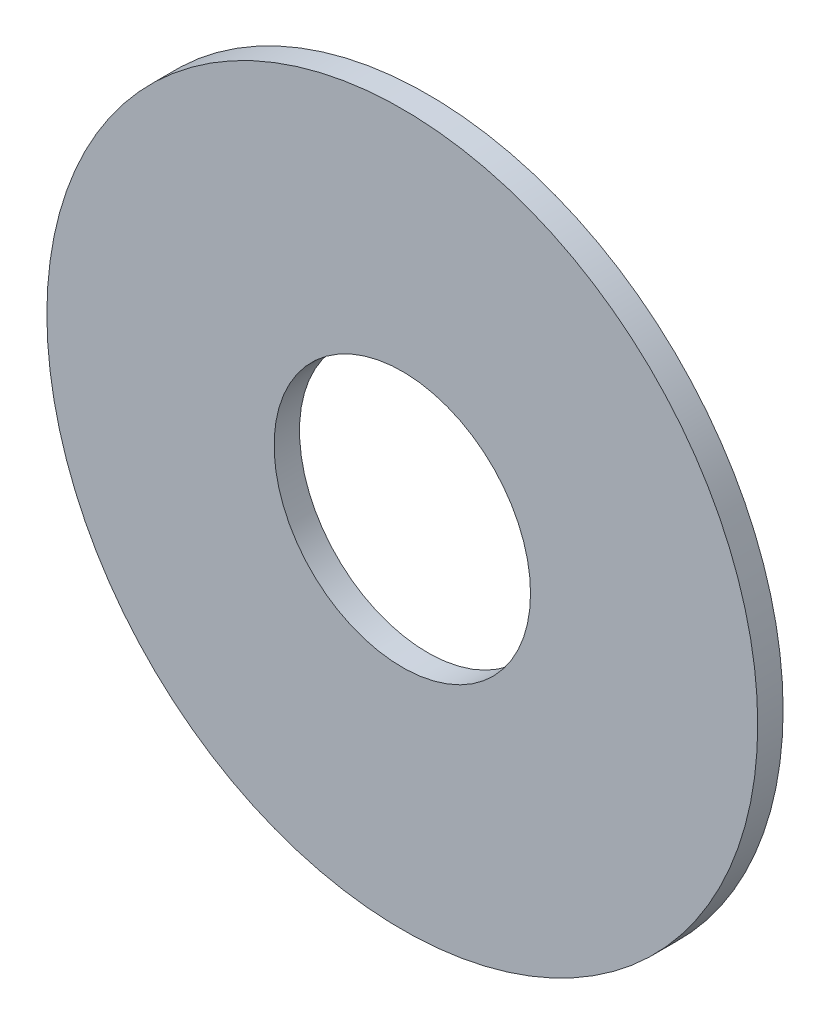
ISO-10303-21;
HEADER;
FILE_DESCRIPTION(('STEP AP214'),'2;1');
FILE_NAME('part.step','',(''),(''),'','','');
FILE_SCHEMA(('AUTOMOTIVE_DESIGN { 1 0 10303 214 1 1 1 1 }'));
ENDSEC;
DATA;
#1=APPLICATION_CONTEXT('core data for automotive mechanical design processes');
#2=APPLICATION_PROTOCOL_DEFINITION('international standard','automotive_design',2000,#1);
#3=PRODUCT_CONTEXT('',#1,'mechanical');
#4=PRODUCT('Part','Part','',(#3));
#5=PRODUCT_RELATED_PRODUCT_CATEGORY('part','',(#4));
#6=PRODUCT_DEFINITION_FORMATION('','',#4);
#7=PRODUCT_DEFINITION_CONTEXT('part definition',#1,'design');
#8=PRODUCT_DEFINITION('design','',#6,#7);
#9=PRODUCT_DEFINITION_SHAPE('','',#8);
#10=(LENGTH_UNIT() NAMED_UNIT(*) SI_UNIT(.MILLI.,.METRE.));
#11=(NAMED_UNIT(*) PLANE_ANGLE_UNIT() SI_UNIT($,.RADIAN.));
#12=(NAMED_UNIT(*) SI_UNIT($,.STERADIAN.) SOLID_ANGLE_UNIT());
#13=UNCERTAINTY_MEASURE_WITH_UNIT(LENGTH_MEASURE(1.E-05),#10,'distance_accuracy_value','');
#14=(GEOMETRIC_REPRESENTATION_CONTEXT(3) GLOBAL_UNCERTAINTY_ASSIGNED_CONTEXT((#13)) GLOBAL_UNIT_ASSIGNED_CONTEXT((#10,
#11,#12)) REPRESENTATION_CONTEXT('',''));
#15=CARTESIAN_POINT('',(0.,0.,0.));
#16=DIRECTION('',(0.,0.,1.));
#17=DIRECTION('',(1.,0.,0.));
#18=AXIS2_PLACEMENT_3D('',#15,#16,#17);
#19=CARTESIAN_POINT('',(0.,29.,1.));
#20=DIRECTION('',(0.,0.,1.));
#21=DIRECTION('',(1.,0.,0.));
#22=AXIS2_PLACEMENT_3D('',#19,#20,#21);
#23=PLANE('',#22);
#24=CARTESIAN_POINT('',(0.,29.,1.));
#25=DIRECTION('',(0.,0.,1.));
#26=DIRECTION('',(1.,0.,0.));
#27=AXIS2_PLACEMENT_3D('',#24,#25,#26);
#28=CIRCLE('',#27,14.);
#29=CARTESIAN_POINT('',(14.,29.,1.));
#30=VERTEX_POINT('',#29);
#31=EDGE_CURVE('E10',#30,#30,#28,.T.);
#32=ORIENTED_EDGE('',*,*,#31,.T.);
#33=EDGE_LOOP('',(#32));
#34=FACE_BOUND('',#33,.T.);
#35=CARTESIAN_POINT('',(0.,29.,1.));
#36=DIRECTION('',(0.,0.,1.));
#37=DIRECTION('',(1.,0.,0.));
#38=AXIS2_PLACEMENT_3D('',#35,#36,#37);
#39=CIRCLE('',#38,5.05);
#40=CARTESIAN_POINT('',(5.05,29.,1.));
#41=VERTEX_POINT('',#40);
#42=EDGE_CURVE('E38',#41,#41,#39,.T.);
#43=ORIENTED_EDGE('',*,*,#42,.F.);
#44=EDGE_LOOP('',(#43));
#45=FACE_BOUND('',#44,.T.);
#46=ADVANCED_FACE('F27',(#34,#45),#23,.T.);
#47=CARTESIAN_POINT('',(0.,29.,0.));
#48=DIRECTION('',(0.,0.,1.));
#49=DIRECTION('',(1.,0.,0.));
#50=AXIS2_PLACEMENT_3D('',#47,#48,#49);
#51=PLANE('',#50);
#52=CARTESIAN_POINT('',(0.,29.,0.));
#53=DIRECTION('',(0.,0.,1.));
#54=DIRECTION('',(1.,0.,0.));
#55=AXIS2_PLACEMENT_3D('',#52,#53,#54);
#56=CIRCLE('',#55,14.);
#57=CARTESIAN_POINT('',(14.,29.,0.));
#58=VERTEX_POINT('',#57);
#59=EDGE_CURVE('E34',#58,#58,#56,.T.);
#60=ORIENTED_EDGE('',*,*,#59,.F.);
#61=EDGE_LOOP('',(#60));
#62=FACE_BOUND('',#61,.T.);
#63=CARTESIAN_POINT('',(0.,29.,0.));
#64=DIRECTION('',(0.,0.,1.));
#65=DIRECTION('',(1.,0.,0.));
#66=AXIS2_PLACEMENT_3D('',#63,#64,#65);
#67=CIRCLE('',#66,5.05);
#68=CARTESIAN_POINT('',(5.05,29.,0.));
#69=VERTEX_POINT('',#68);
#70=EDGE_CURVE('E42',#69,#69,#67,.T.);
#71=ORIENTED_EDGE('',*,*,#70,.T.);
#72=EDGE_LOOP('',(#71));
#73=FACE_BOUND('',#72,.T.);
#74=ADVANCED_FACE('F48',(#62,#73),#51,.F.);
#75=CARTESIAN_POINT('',(0.,29.,1.));
#76=DIRECTION('',(0.,0.,-1.));
#77=DIRECTION('',(-1.,0.,0.));
#78=AXIS2_PLACEMENT_3D('',#75,#76,#77);
#79=CYLINDRICAL_SURFACE('',#78,14.);
#80=ORIENTED_EDGE('',*,*,#31,.F.);
#81=EDGE_LOOP('',(#80));
#82=FACE_BOUND('',#81,.T.);
#83=ORIENTED_EDGE('',*,*,#59,.T.);
#84=EDGE_LOOP('',(#83));
#85=FACE_BOUND('',#84,.T.);
#86=ADVANCED_FACE('F29',(#82,#85),#79,.T.);
#87=CARTESIAN_POINT('',(0.,29.,1.));
#88=DIRECTION('',(0.,0.,-1.));
#89=DIRECTION('',(-1.,0.,0.));
#90=AXIS2_PLACEMENT_3D('',#87,#88,#89);
#91=CYLINDRICAL_SURFACE('',#90,5.05);
#92=ORIENTED_EDGE('',*,*,#42,.T.);
#93=EDGE_LOOP('',(#92));
#94=FACE_BOUND('',#93,.T.);
#95=ORIENTED_EDGE('',*,*,#70,.F.);
#96=EDGE_LOOP('',(#95));
#97=FACE_BOUND('',#96,.T.);
#98=ADVANCED_FACE('F50',(#94,#97),#91,.F.);
#99=CLOSED_SHELL('',(#46,#74,#86,#98));
#100=MANIFOLD_SOLID_BREP('B2',#99);
#101=ADVANCED_BREP_SHAPE_REPRESENTATION('',(#18,#100),#14);
#102=SHAPE_DEFINITION_REPRESENTATION(#9,#101);
ENDSEC;
END-ISO-10303-21;
